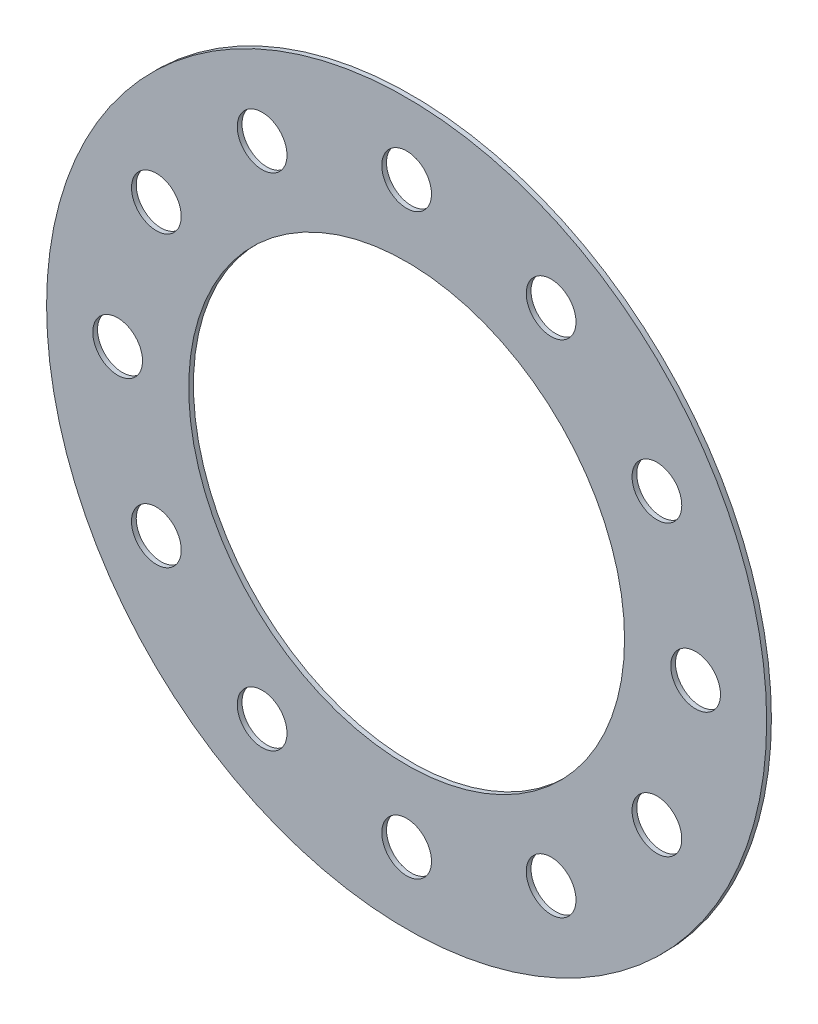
ISO-10303-21;
HEADER;
FILE_DESCRIPTION(('STEP AP214'),'2;1');
FILE_NAME('part.step','',(''),(''),'','','');
FILE_SCHEMA(('AUTOMOTIVE_DESIGN { 1 0 10303 214 1 1 1 1 }'));
ENDSEC;
DATA;
#1=APPLICATION_CONTEXT('core data for automotive mechanical design processes');
#2=APPLICATION_PROTOCOL_DEFINITION('international standard','automotive_design',2000,#1);
#3=PRODUCT_CONTEXT('',#1,'mechanical');
#4=PRODUCT('Part','Part','',(#3));
#5=PRODUCT_RELATED_PRODUCT_CATEGORY('part','',(#4));
#6=PRODUCT_DEFINITION_FORMATION('','',#4);
#7=PRODUCT_DEFINITION_CONTEXT('part definition',#1,'design');
#8=PRODUCT_DEFINITION('design','',#6,#7);
#9=PRODUCT_DEFINITION_SHAPE('','',#8);
#10=(LENGTH_UNIT() NAMED_UNIT(*) SI_UNIT(.MILLI.,.METRE.));
#11=(NAMED_UNIT(*) PLANE_ANGLE_UNIT() SI_UNIT($,.RADIAN.));
#12=(NAMED_UNIT(*) SI_UNIT($,.STERADIAN.) SOLID_ANGLE_UNIT());
#13=UNCERTAINTY_MEASURE_WITH_UNIT(LENGTH_MEASURE(1.E-05),#10,'distance_accuracy_value','');
#14=(GEOMETRIC_REPRESENTATION_CONTEXT(3) GLOBAL_UNCERTAINTY_ASSIGNED_CONTEXT((#13)) GLOBAL_UNIT_ASSIGNED_CONTEXT((#10,
#11,#12)) REPRESENTATION_CONTEXT('',''));
#15=CARTESIAN_POINT('',(0.,0.,0.));
#16=DIRECTION('',(0.,0.,1.));
#17=DIRECTION('',(1.,0.,0.));
#18=AXIS2_PLACEMENT_3D('',#15,#16,#17);
#19=CARTESIAN_POINT('',(0.,0.,1.));
#20=DIRECTION('',(0.,0.,1.));
#21=DIRECTION('',(1.,0.,0.));
#22=AXIS2_PLACEMENT_3D('',#19,#20,#21);
#23=PLANE('',#22);
#24=CARTESIAN_POINT('',(30.4999999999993,52.8275496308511,1.));
#25=DIRECTION('',(0.,0.,-1.));
#26=DIRECTION('',(-0.866025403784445,0.499999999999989,0.));
#27=AXIS2_PLACEMENT_3D('',#24,#25,#26);
#28=CIRCLE('',#27,5.25);
#29=CARTESIAN_POINT('',(25.953366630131,55.4525496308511,1.));
#30=VERTEX_POINT('',#29);
#31=EDGE_CURVE('E111',#30,#30,#28,.T.);
#32=ORIENTED_EDGE('',*,*,#31,.T.);
#33=EDGE_LOOP('',(#32));
#34=FACE_BOUND('',#33,.T.);
#35=CARTESIAN_POINT('',(52.8275496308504,30.5000000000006,1.));
#36=DIRECTION('',(0.,0.,-1.));
#37=DIRECTION('',(-0.50000000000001,0.866025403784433,0.));
#38=AXIS2_PLACEMENT_3D('',#35,#36,#37);
#39=CIRCLE('',#38,5.25);
#40=CARTESIAN_POINT('',(50.2025496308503,35.0466333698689,1.));
#41=VERTEX_POINT('',#40);
#42=EDGE_CURVE('E105',#41,#41,#39,.T.);
#43=ORIENTED_EDGE('',*,*,#42,.T.);
#44=EDGE_LOOP('',(#43));
#45=FACE_BOUND('',#44,.T.);
#46=CARTESIAN_POINT('',(61.,6.38941085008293E-13,1.));
#47=DIRECTION('',(0.,0.,-1.));
#48=DIRECTION('',(0.,1.,0.));
#49=AXIS2_PLACEMENT_3D('',#46,#47,#48);
#50=CIRCLE('',#49,5.25);
#51=CARTESIAN_POINT('',(60.9999999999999,5.25000000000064,1.));
#52=VERTEX_POINT('',#51);
#53=EDGE_CURVE('E99',#52,#52,#50,.T.);
#54=ORIENTED_EDGE('',*,*,#53,.T.);
#55=EDGE_LOOP('',(#54));
#56=FACE_BOUND('',#55,.T.);
#57=CARTESIAN_POINT('',(52.827549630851,-30.4999999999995,1.));
#58=DIRECTION('',(0.,0.,-1.));
#59=DIRECTION('',(0.499999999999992,0.866025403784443,0.));
#60=AXIS2_PLACEMENT_3D('',#57,#58,#59);
#61=CIRCLE('',#60,5.25);
#62=CARTESIAN_POINT('',(55.452549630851,-25.9533666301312,1.));
#63=VERTEX_POINT('',#62);
#64=EDGE_CURVE('E93',#63,#63,#61,.T.);
#65=ORIENTED_EDGE('',*,*,#64,.T.);
#66=EDGE_LOOP('',(#65));
#67=FACE_BOUND('',#66,.T.);
#68=CARTESIAN_POINT('',(30.5000000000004,-52.8275496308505,1.));
#69=DIRECTION('',(0.,0.,-1.));
#70=DIRECTION('',(0.866025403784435,0.500000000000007,0.));
#71=AXIS2_PLACEMENT_3D('',#68,#69,#70);
#72=CIRCLE('',#71,5.25);
#73=CARTESIAN_POINT('',(35.0466333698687,-50.2025496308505,1.));
#74=VERTEX_POINT('',#73);
#75=EDGE_CURVE('E87',#74,#74,#72,.T.);
#76=ORIENTED_EDGE('',*,*,#75,.T.);
#77=EDGE_LOOP('',(#76));
#78=FACE_BOUND('',#77,.T.);
#79=CARTESIAN_POINT('',(0.,-61.,1.));
#80=DIRECTION('',(0.,0.,-1.));
#81=DIRECTION('',(1.,0.,0.));
#82=AXIS2_PLACEMENT_3D('',#79,#80,#81);
#83=CIRCLE('',#82,5.25);
#84=CARTESIAN_POINT('',(5.25,-61.,1.));
#85=VERTEX_POINT('',#84);
#86=EDGE_CURVE('E81',#85,#85,#83,.T.);
#87=ORIENTED_EDGE('',*,*,#86,.T.);
#88=EDGE_LOOP('',(#87));
#89=FACE_BOUND('',#88,.T.);
#90=CARTESIAN_POINT('',(-30.4999999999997,-52.8275496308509,1.));
#91=DIRECTION('',(0.,0.,-1.));
#92=DIRECTION('',(0.866025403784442,-0.499999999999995,0.));
#93=AXIS2_PLACEMENT_3D('',#90,#91,#92);
#94=CIRCLE('',#93,5.25);
#95=CARTESIAN_POINT('',(-25.9533666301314,-55.4525496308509,1.));
#96=VERTEX_POINT('',#95);
#97=EDGE_CURVE('E75',#96,#96,#94,.T.);
#98=ORIENTED_EDGE('',*,*,#97,.T.);
#99=EDGE_LOOP('',(#98));
#100=FACE_BOUND('',#99,.T.);
#101=CARTESIAN_POINT('',(-52.8275496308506,-30.5000000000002,1.));
#102=DIRECTION('',(0.,0.,-1.));
#103=DIRECTION('',(0.500000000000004,-0.866025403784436,0.));
#104=AXIS2_PLACEMENT_3D('',#101,#102,#103);
#105=CIRCLE('',#104,5.25);
#106=CARTESIAN_POINT('',(-50.2025496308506,-35.0466333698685,1.));
#107=VERTEX_POINT('',#106);
#108=EDGE_CURVE('E69',#107,#107,#105,.T.);
#109=ORIENTED_EDGE('',*,*,#108,.T.);
#110=EDGE_LOOP('',(#109));
#111=FACE_BOUND('',#110,.T.);
#112=CARTESIAN_POINT('',(-61.,-2.12980361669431E-13,1.));
#113=DIRECTION('',(0.,0.,-1.));
#114=DIRECTION('',(0.,-1.,0.));
#115=AXIS2_PLACEMENT_3D('',#112,#113,#114);
#116=CIRCLE('',#115,5.25);
#117=CARTESIAN_POINT('',(-61.,-5.25000000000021,1.));
#118=VERTEX_POINT('',#117);
#119=EDGE_CURVE('E63',#118,#118,#116,.T.);
#120=ORIENTED_EDGE('',*,*,#119,.T.);
#121=EDGE_LOOP('',(#120));
#122=FACE_BOUND('',#121,.T.);
#123=CARTESIAN_POINT('',(-52.8275496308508,30.4999999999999,1.));
#124=DIRECTION('',(0.,0.,-1.));
#125=DIRECTION('',(-0.499999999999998,-0.86602540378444,0.));
#126=AXIS2_PLACEMENT_3D('',#123,#124,#125);
#127=CIRCLE('',#126,5.25);
#128=CARTESIAN_POINT('',(-55.4525496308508,25.9533666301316,1.));
#129=VERTEX_POINT('',#128);
#130=EDGE_CURVE('E57',#129,#129,#127,.T.);
#131=ORIENTED_EDGE('',*,*,#130,.T.);
#132=EDGE_LOOP('',(#131));
#133=FACE_BOUND('',#132,.T.);
#134=CARTESIAN_POINT('',(-30.5000000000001,52.8275496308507,1.));
#135=DIRECTION('',(0.,0.,-1.));
#136=DIRECTION('',(-0.866025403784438,-0.500000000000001,0.));
#137=AXIS2_PLACEMENT_3D('',#134,#135,#136);
#138=CIRCLE('',#137,5.25);
#139=CARTESIAN_POINT('',(-35.0466333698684,50.2025496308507,1.));
#140=VERTEX_POINT('',#139);
#141=EDGE_CURVE('E51',#140,#140,#138,.T.);
#142=ORIENTED_EDGE('',*,*,#141,.T.);
#143=EDGE_LOOP('',(#142));
#144=FACE_BOUND('',#143,.T.);
#145=CARTESIAN_POINT('',(0.,61.,1.));
#146=DIRECTION('',(0.,0.,-1.));
#147=DIRECTION('',(-1.,0.,0.));
#148=AXIS2_PLACEMENT_3D('',#145,#146,#147);
#149=CIRCLE('',#148,5.25);
#150=CARTESIAN_POINT('',(-5.25,61.,1.));
#151=VERTEX_POINT('',#150);
#152=EDGE_CURVE('E45',#151,#151,#149,.T.);
#153=ORIENTED_EDGE('',*,*,#152,.T.);
#154=EDGE_LOOP('',(#153));
#155=FACE_BOUND('',#154,.T.);
#156=CARTESIAN_POINT('',(0.,0.,1.));
#157=DIRECTION('',(0.,0.,1.));
#158=DIRECTION('',(1.,0.,0.));
#159=AXIS2_PLACEMENT_3D('',#156,#157,#158);
#160=CIRCLE('',#159,76.);
#161=CARTESIAN_POINT('',(76.,0.,1.));
#162=VERTEX_POINT('',#161);
#163=EDGE_CURVE('E10',#162,#162,#160,.T.);
#164=ORIENTED_EDGE('',*,*,#163,.T.);
#165=EDGE_LOOP('',(#164));
#166=FACE_BOUND('',#165,.T.);
#167=CARTESIAN_POINT('',(0.,0.,1.));
#168=DIRECTION('',(0.,0.,1.));
#169=DIRECTION('',(1.,0.,0.));
#170=AXIS2_PLACEMENT_3D('',#167,#168,#169);
#171=CIRCLE('',#170,46.);
#172=CARTESIAN_POINT('',(46.,0.,1.));
#173=VERTEX_POINT('',#172);
#174=EDGE_CURVE('E40',#173,#173,#171,.T.);
#175=ORIENTED_EDGE('',*,*,#174,.F.);
#176=EDGE_LOOP('',(#175));
#177=FACE_BOUND('',#176,.T.);
#178=ADVANCED_FACE('F29',(#34,#45,#56,#67,#78,#89,#100,#111,#122,#133,#144,#155,#166,#177),#23,.T.);
#179=CARTESIAN_POINT('',(0.,0.,0.));
#180=DIRECTION('',(0.,0.,1.));
#181=DIRECTION('',(1.,0.,0.));
#182=AXIS2_PLACEMENT_3D('',#179,#180,#181);
#183=PLANE('',#182);
#184=CARTESIAN_POINT('',(30.4999999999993,52.8275496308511,0.));
#185=DIRECTION('',(0.,0.,-1.));
#186=DIRECTION('',(-0.866025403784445,0.499999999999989,0.));
#187=AXIS2_PLACEMENT_3D('',#184,#185,#186);
#188=CIRCLE('',#187,5.25);
#189=CARTESIAN_POINT('',(25.953366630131,55.4525496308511,0.));
#190=VERTEX_POINT('',#189);
#191=EDGE_CURVE('E114',#190,#190,#188,.T.);
#192=ORIENTED_EDGE('',*,*,#191,.F.);
#193=EDGE_LOOP('',(#192));
#194=FACE_BOUND('',#193,.T.);
#195=CARTESIAN_POINT('',(52.8275496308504,30.5000000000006,0.));
#196=DIRECTION('',(0.,0.,-1.));
#197=DIRECTION('',(-0.50000000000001,0.866025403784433,0.));
#198=AXIS2_PLACEMENT_3D('',#195,#196,#197);
#199=CIRCLE('',#198,5.25);
#200=CARTESIAN_POINT('',(50.2025496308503,35.0466333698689,0.));
#201=VERTEX_POINT('',#200);
#202=EDGE_CURVE('E108',#201,#201,#199,.T.);
#203=ORIENTED_EDGE('',*,*,#202,.F.);
#204=EDGE_LOOP('',(#203));
#205=FACE_BOUND('',#204,.T.);
#206=CARTESIAN_POINT('',(61.,6.38941085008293E-13,0.));
#207=DIRECTION('',(0.,0.,-1.));
#208=DIRECTION('',(0.,1.,0.));
#209=AXIS2_PLACEMENT_3D('',#206,#207,#208);
#210=CIRCLE('',#209,5.25);
#211=CARTESIAN_POINT('',(60.9999999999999,5.25000000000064,0.));
#212=VERTEX_POINT('',#211);
#213=EDGE_CURVE('E102',#212,#212,#210,.T.);
#214=ORIENTED_EDGE('',*,*,#213,.F.);
#215=EDGE_LOOP('',(#214));
#216=FACE_BOUND('',#215,.T.);
#217=CARTESIAN_POINT('',(52.827549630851,-30.4999999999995,0.));
#218=DIRECTION('',(0.,0.,-1.));
#219=DIRECTION('',(0.499999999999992,0.866025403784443,0.));
#220=AXIS2_PLACEMENT_3D('',#217,#218,#219);
#221=CIRCLE('',#220,5.25);
#222=CARTESIAN_POINT('',(55.452549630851,-25.9533666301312,0.));
#223=VERTEX_POINT('',#222);
#224=EDGE_CURVE('E96',#223,#223,#221,.T.);
#225=ORIENTED_EDGE('',*,*,#224,.F.);
#226=EDGE_LOOP('',(#225));
#227=FACE_BOUND('',#226,.T.);
#228=CARTESIAN_POINT('',(30.5000000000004,-52.8275496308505,0.));
#229=DIRECTION('',(0.,0.,-1.));
#230=DIRECTION('',(0.866025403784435,0.500000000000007,0.));
#231=AXIS2_PLACEMENT_3D('',#228,#229,#230);
#232=CIRCLE('',#231,5.25);
#233=CARTESIAN_POINT('',(35.0466333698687,-50.2025496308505,0.));
#234=VERTEX_POINT('',#233);
#235=EDGE_CURVE('E90',#234,#234,#232,.T.);
#236=ORIENTED_EDGE('',*,*,#235,.F.);
#237=EDGE_LOOP('',(#236));
#238=FACE_BOUND('',#237,.T.);
#239=CARTESIAN_POINT('',(0.,-61.,0.));
#240=DIRECTION('',(0.,0.,-1.));
#241=DIRECTION('',(1.,0.,0.));
#242=AXIS2_PLACEMENT_3D('',#239,#240,#241);
#243=CIRCLE('',#242,5.25);
#244=CARTESIAN_POINT('',(5.25,-61.,0.));
#245=VERTEX_POINT('',#244);
#246=EDGE_CURVE('E84',#245,#245,#243,.T.);
#247=ORIENTED_EDGE('',*,*,#246,.F.);
#248=EDGE_LOOP('',(#247));
#249=FACE_BOUND('',#248,.T.);
#250=CARTESIAN_POINT('',(-30.4999999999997,-52.8275496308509,0.));
#251=DIRECTION('',(0.,0.,-1.));
#252=DIRECTION('',(0.866025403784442,-0.499999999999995,0.));
#253=AXIS2_PLACEMENT_3D('',#250,#251,#252);
#254=CIRCLE('',#253,5.25);
#255=CARTESIAN_POINT('',(-25.9533666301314,-55.4525496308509,0.));
#256=VERTEX_POINT('',#255);
#257=EDGE_CURVE('E78',#256,#256,#254,.T.);
#258=ORIENTED_EDGE('',*,*,#257,.F.);
#259=EDGE_LOOP('',(#258));
#260=FACE_BOUND('',#259,.T.);
#261=CARTESIAN_POINT('',(-52.8275496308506,-30.5000000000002,0.));
#262=DIRECTION('',(0.,0.,-1.));
#263=DIRECTION('',(0.500000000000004,-0.866025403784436,0.));
#264=AXIS2_PLACEMENT_3D('',#261,#262,#263);
#265=CIRCLE('',#264,5.25);
#266=CARTESIAN_POINT('',(-50.2025496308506,-35.0466333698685,0.));
#267=VERTEX_POINT('',#266);
#268=EDGE_CURVE('E72',#267,#267,#265,.T.);
#269=ORIENTED_EDGE('',*,*,#268,.F.);
#270=EDGE_LOOP('',(#269));
#271=FACE_BOUND('',#270,.T.);
#272=CARTESIAN_POINT('',(-61.,-2.12980361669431E-13,0.));
#273=DIRECTION('',(0.,0.,-1.));
#274=DIRECTION('',(0.,-1.,0.));
#275=AXIS2_PLACEMENT_3D('',#272,#273,#274);
#276=CIRCLE('',#275,5.25);
#277=CARTESIAN_POINT('',(-61.,-5.25000000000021,0.));
#278=VERTEX_POINT('',#277);
#279=EDGE_CURVE('E66',#278,#278,#276,.T.);
#280=ORIENTED_EDGE('',*,*,#279,.F.);
#281=EDGE_LOOP('',(#280));
#282=FACE_BOUND('',#281,.T.);
#283=CARTESIAN_POINT('',(-52.8275496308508,30.4999999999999,0.));
#284=DIRECTION('',(0.,0.,-1.));
#285=DIRECTION('',(-0.499999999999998,-0.86602540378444,0.));
#286=AXIS2_PLACEMENT_3D('',#283,#284,#285);
#287=CIRCLE('',#286,5.25);
#288=CARTESIAN_POINT('',(-55.4525496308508,25.9533666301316,0.));
#289=VERTEX_POINT('',#288);
#290=EDGE_CURVE('E60',#289,#289,#287,.T.);
#291=ORIENTED_EDGE('',*,*,#290,.F.);
#292=EDGE_LOOP('',(#291));
#293=FACE_BOUND('',#292,.T.);
#294=CARTESIAN_POINT('',(-30.5000000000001,52.8275496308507,0.));
#295=DIRECTION('',(0.,0.,-1.));
#296=DIRECTION('',(-0.866025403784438,-0.500000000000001,0.));
#297=AXIS2_PLACEMENT_3D('',#294,#295,#296);
#298=CIRCLE('',#297,5.25);
#299=CARTESIAN_POINT('',(-35.0466333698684,50.2025496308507,0.));
#300=VERTEX_POINT('',#299);
#301=EDGE_CURVE('E54',#300,#300,#298,.T.);
#302=ORIENTED_EDGE('',*,*,#301,.F.);
#303=EDGE_LOOP('',(#302));
#304=FACE_BOUND('',#303,.T.);
#305=CARTESIAN_POINT('',(0.,61.,0.));
#306=DIRECTION('',(0.,0.,-1.));
#307=DIRECTION('',(-1.,0.,0.));
#308=AXIS2_PLACEMENT_3D('',#305,#306,#307);
#309=CIRCLE('',#308,5.25);
#310=CARTESIAN_POINT('',(-5.25,61.,0.));
#311=VERTEX_POINT('',#310);
#312=EDGE_CURVE('E48',#311,#311,#309,.T.);
#313=ORIENTED_EDGE('',*,*,#312,.F.);
#314=EDGE_LOOP('',(#313));
#315=FACE_BOUND('',#314,.T.);
#316=CARTESIAN_POINT('',(0.,0.,0.));
#317=DIRECTION('',(0.,0.,1.));
#318=DIRECTION('',(1.,0.,0.));
#319=AXIS2_PLACEMENT_3D('',#316,#317,#318);
#320=CIRCLE('',#319,76.);
#321=CARTESIAN_POINT('',(76.,0.,0.));
#322=VERTEX_POINT('',#321);
#323=EDGE_CURVE('E33',#322,#322,#320,.T.);
#324=ORIENTED_EDGE('',*,*,#323,.F.);
#325=EDGE_LOOP('',(#324));
#326=FACE_BOUND('',#325,.T.);
#327=CARTESIAN_POINT('',(0.,0.,0.));
#328=DIRECTION('',(0.,0.,1.));
#329=DIRECTION('',(1.,0.,0.));
#330=AXIS2_PLACEMENT_3D('',#327,#328,#329);
#331=CIRCLE('',#330,46.);
#332=CARTESIAN_POINT('',(46.,0.,0.));
#333=VERTEX_POINT('',#332);
#334=EDGE_CURVE('E42',#333,#333,#331,.T.);
#335=ORIENTED_EDGE('',*,*,#334,.T.);
#336=EDGE_LOOP('',(#335));
#337=FACE_BOUND('',#336,.T.);
#338=ADVANCED_FACE('F129',(#194,#205,#216,#227,#238,#249,#260,#271,#282,#293,#304,#315,#326,
#337),#183,.F.);
#339=CARTESIAN_POINT('',(0.,0.,1.));
#340=DIRECTION('',(0.,0.,-1.));
#341=DIRECTION('',(-1.,0.,0.));
#342=AXIS2_PLACEMENT_3D('',#339,#340,#341);
#343=CYLINDRICAL_SURFACE('',#342,76.);
#344=ORIENTED_EDGE('',*,*,#163,.F.);
#345=EDGE_LOOP('',(#344));
#346=FACE_BOUND('',#345,.T.);
#347=ORIENTED_EDGE('',*,*,#323,.T.);
#348=EDGE_LOOP('',(#347));
#349=FACE_BOUND('',#348,.T.);
#350=ADVANCED_FACE('F31',(#346,#349),#343,.T.);
#351=CARTESIAN_POINT('',(0.,0.,1.));
#352=DIRECTION('',(0.,0.,-1.));
#353=DIRECTION('',(-1.,0.,0.));
#354=AXIS2_PLACEMENT_3D('',#351,#352,#353);
#355=CYLINDRICAL_SURFACE('',#354,46.);
#356=ORIENTED_EDGE('',*,*,#174,.T.);
#357=EDGE_LOOP('',(#356));
#358=FACE_BOUND('',#357,.T.);
#359=ORIENTED_EDGE('',*,*,#334,.F.);
#360=EDGE_LOOP('',(#359));
#361=FACE_BOUND('',#360,.T.);
#362=ADVANCED_FACE('F158',(#358,#361),#355,.F.);
#363=CARTESIAN_POINT('',(0.,61.,1.));
#364=DIRECTION('',(0.,0.,-1.));
#365=DIRECTION('',(-1.,0.,0.));
#366=AXIS2_PLACEMENT_3D('',#363,#364,#365);
#367=CYLINDRICAL_SURFACE('',#366,5.25);
#368=ORIENTED_EDGE('',*,*,#152,.F.);
#369=EDGE_LOOP('',(#368));
#370=FACE_BOUND('',#369,.T.);
#371=ORIENTED_EDGE('',*,*,#312,.T.);
#372=EDGE_LOOP('',(#371));
#373=FACE_BOUND('',#372,.T.);
#374=ADVANCED_FACE('F160',(#370,#373),#367,.F.);
#375=CARTESIAN_POINT('',(-30.5000000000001,52.8275496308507,1.));
#376=DIRECTION('',(0.,0.,-1.));
#377=DIRECTION('',(-1.,0.,0.));
#378=AXIS2_PLACEMENT_3D('',#375,#376,#377);
#379=CYLINDRICAL_SURFACE('',#378,5.25);
#380=ORIENTED_EDGE('',*,*,#141,.F.);
#381=EDGE_LOOP('',(#380));
#382=FACE_BOUND('',#381,.T.);
#383=ORIENTED_EDGE('',*,*,#301,.T.);
#384=EDGE_LOOP('',(#383));
#385=FACE_BOUND('',#384,.T.);
#386=ADVANCED_FACE('F167',(#382,#385),#379,.F.);
#387=CARTESIAN_POINT('',(-52.8275496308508,30.4999999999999,1.));
#388=DIRECTION('',(0.,0.,-1.));
#389=DIRECTION('',(-1.,0.,0.));
#390=AXIS2_PLACEMENT_3D('',#387,#388,#389);
#391=CYLINDRICAL_SURFACE('',#390,5.25);
#392=ORIENTED_EDGE('',*,*,#130,.F.);
#393=EDGE_LOOP('',(#392));
#394=FACE_BOUND('',#393,.T.);
#395=ORIENTED_EDGE('',*,*,#290,.T.);
#396=EDGE_LOOP('',(#395));
#397=FACE_BOUND('',#396,.T.);
#398=ADVANCED_FACE('F202',(#394,#397),#391,.F.);
#399=CARTESIAN_POINT('',(-61.,-2.12980361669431E-13,1.));
#400=DIRECTION('',(0.,0.,-1.));
#401=DIRECTION('',(-1.,0.,0.));
#402=AXIS2_PLACEMENT_3D('',#399,#400,#401);
#403=CYLINDRICAL_SURFACE('',#402,5.25);
#404=ORIENTED_EDGE('',*,*,#119,.F.);
#405=EDGE_LOOP('',(#404));
#406=FACE_BOUND('',#405,.T.);
#407=ORIENTED_EDGE('',*,*,#279,.T.);
#408=EDGE_LOOP('',(#407));
#409=FACE_BOUND('',#408,.T.);
#410=ADVANCED_FACE('F209',(#406,#409),#403,.F.);
#411=CARTESIAN_POINT('',(-52.8275496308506,-30.5000000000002,1.));
#412=DIRECTION('',(0.,0.,-1.));
#413=DIRECTION('',(-1.,0.,0.));
#414=AXIS2_PLACEMENT_3D('',#411,#412,#413);
#415=CYLINDRICAL_SURFACE('',#414,5.25);
#416=ORIENTED_EDGE('',*,*,#108,.F.);
#417=EDGE_LOOP('',(#416));
#418=FACE_BOUND('',#417,.T.);
#419=ORIENTED_EDGE('',*,*,#268,.T.);
#420=EDGE_LOOP('',(#419));
#421=FACE_BOUND('',#420,.T.);
#422=ADVANCED_FACE('F217',(#418,#421),#415,.F.);
#423=CARTESIAN_POINT('',(-30.4999999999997,-52.8275496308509,1.));
#424=DIRECTION('',(0.,0.,-1.));
#425=DIRECTION('',(-1.,0.,0.));
#426=AXIS2_PLACEMENT_3D('',#423,#424,#425);
#427=CYLINDRICAL_SURFACE('',#426,5.25);
#428=ORIENTED_EDGE('',*,*,#97,.F.);
#429=EDGE_LOOP('',(#428));
#430=FACE_BOUND('',#429,.T.);
#431=ORIENTED_EDGE('',*,*,#257,.T.);
#432=EDGE_LOOP('',(#431));
#433=FACE_BOUND('',#432,.T.);
#434=ADVANCED_FACE('F225',(#430,#433),#427,.F.);
#435=CARTESIAN_POINT('',(0.,-61.,1.));
#436=DIRECTION('',(0.,0.,-1.));
#437=DIRECTION('',(-1.,0.,0.));
#438=AXIS2_PLACEMENT_3D('',#435,#436,#437);
#439=CYLINDRICAL_SURFACE('',#438,5.25);
#440=ORIENTED_EDGE('',*,*,#86,.F.);
#441=EDGE_LOOP('',(#440));
#442=FACE_BOUND('',#441,.T.);
#443=ORIENTED_EDGE('',*,*,#246,.T.);
#444=EDGE_LOOP('',(#443));
#445=FACE_BOUND('',#444,.T.);
#446=ADVANCED_FACE('F233',(#442,#445),#439,.F.);
#447=CARTESIAN_POINT('',(30.5000000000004,-52.8275496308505,1.));
#448=DIRECTION('',(0.,0.,-1.));
#449=DIRECTION('',(-1.,0.,0.));
#450=AXIS2_PLACEMENT_3D('',#447,#448,#449);
#451=CYLINDRICAL_SURFACE('',#450,5.25);
#452=ORIENTED_EDGE('',*,*,#75,.F.);
#453=EDGE_LOOP('',(#452));
#454=FACE_BOUND('',#453,.T.);
#455=ORIENTED_EDGE('',*,*,#235,.T.);
#456=EDGE_LOOP('',(#455));
#457=FACE_BOUND('',#456,.T.);
#458=ADVANCED_FACE('F241',(#454,#457),#451,.F.);
#459=CARTESIAN_POINT('',(52.827549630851,-30.4999999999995,1.));
#460=DIRECTION('',(0.,0.,-1.));
#461=DIRECTION('',(-1.,0.,0.));
#462=AXIS2_PLACEMENT_3D('',#459,#460,#461);
#463=CYLINDRICAL_SURFACE('',#462,5.25);
#464=ORIENTED_EDGE('',*,*,#64,.F.);
#465=EDGE_LOOP('',(#464));
#466=FACE_BOUND('',#465,.T.);
#467=ORIENTED_EDGE('',*,*,#224,.T.);
#468=EDGE_LOOP('',(#467));
#469=FACE_BOUND('',#468,.T.);
#470=ADVANCED_FACE('F249',(#466,#469),#463,.F.);
#471=CARTESIAN_POINT('',(61.,6.38941085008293E-13,1.));
#472=DIRECTION('',(0.,0.,-1.));
#473=DIRECTION('',(-1.,0.,0.));
#474=AXIS2_PLACEMENT_3D('',#471,#472,#473);
#475=CYLINDRICAL_SURFACE('',#474,5.25);
#476=ORIENTED_EDGE('',*,*,#53,.F.);
#477=EDGE_LOOP('',(#476));
#478=FACE_BOUND('',#477,.T.);
#479=ORIENTED_EDGE('',*,*,#213,.T.);
#480=EDGE_LOOP('',(#479));
#481=FACE_BOUND('',#480,.T.);
#482=ADVANCED_FACE('F257',(#478,#481),#475,.F.);
#483=CARTESIAN_POINT('',(52.8275496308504,30.5000000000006,1.));
#484=DIRECTION('',(0.,0.,-1.));
#485=DIRECTION('',(-1.,0.,0.));
#486=AXIS2_PLACEMENT_3D('',#483,#484,#485);
#487=CYLINDRICAL_SURFACE('',#486,5.25);
#488=ORIENTED_EDGE('',*,*,#42,.F.);
#489=EDGE_LOOP('',(#488));
#490=FACE_BOUND('',#489,.T.);
#491=ORIENTED_EDGE('',*,*,#202,.T.);
#492=EDGE_LOOP('',(#491));
#493=FACE_BOUND('',#492,.T.);
#494=ADVANCED_FACE('F125',(#490,#493),#487,.F.);
#495=CARTESIAN_POINT('',(30.4999999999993,52.8275496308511,1.));
#496=DIRECTION('',(0.,0.,-1.));
#497=DIRECTION('',(-1.,0.,0.));
#498=AXIS2_PLACEMENT_3D('',#495,#496,#497);
#499=CYLINDRICAL_SURFACE('',#498,5.25);
#500=ORIENTED_EDGE('',*,*,#31,.F.);
#501=EDGE_LOOP('',(#500));
#502=FACE_BOUND('',#501,.T.);
#503=ORIENTED_EDGE('',*,*,#191,.T.);
#504=EDGE_LOOP('',(#503));
#505=FACE_BOUND('',#504,.T.);
#506=ADVANCED_FACE('F122',(#502,#505),#499,.F.);
#507=CLOSED_SHELL('',(#178,#338,#350,#362,#374,#386,#398,#410,#422,#434,#446,#458,#470,#482,
#494,#506));
#508=MANIFOLD_SOLID_BREP('B2',#507);
#509=ADVANCED_BREP_SHAPE_REPRESENTATION('',(#18,#508),#14);
#510=SHAPE_DEFINITION_REPRESENTATION(#9,#509);
ENDSEC;
END-ISO-10303-21;
